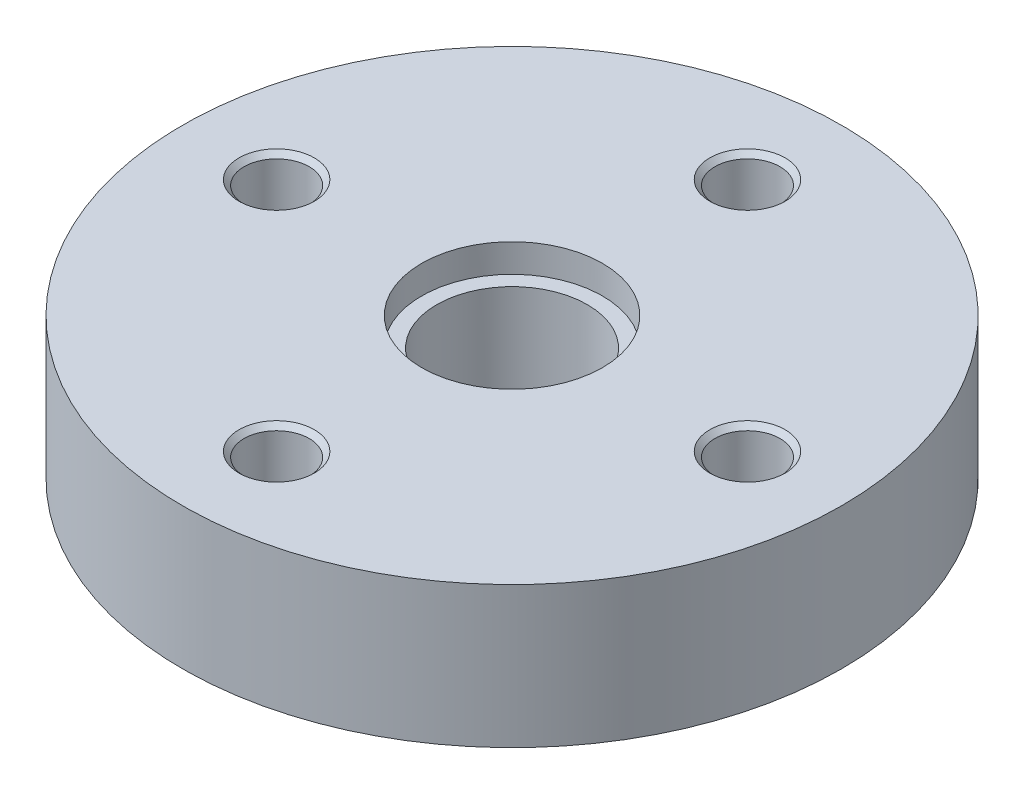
ISO-10303-21;
HEADER;
FILE_DESCRIPTION(('STEP AP214'),'2;1');
FILE_NAME('part.step','',(''),(''),'','','');
FILE_SCHEMA(('AUTOMOTIVE_DESIGN { 1 0 10303 214 1 1 1 1 }'));
ENDSEC;
DATA;
#1=APPLICATION_CONTEXT('core data for automotive mechanical design processes');
#2=APPLICATION_PROTOCOL_DEFINITION('international standard','automotive_design',2000,#1);
#3=PRODUCT_CONTEXT('',#1,'mechanical');
#4=PRODUCT('Part','Part','',(#3));
#5=PRODUCT_RELATED_PRODUCT_CATEGORY('part','',(#4));
#6=PRODUCT_DEFINITION_FORMATION('','',#4);
#7=PRODUCT_DEFINITION_CONTEXT('part definition',#1,'design');
#8=PRODUCT_DEFINITION('design','',#6,#7);
#9=PRODUCT_DEFINITION_SHAPE('','',#8);
#10=(LENGTH_UNIT() NAMED_UNIT(*) SI_UNIT(.MILLI.,.METRE.));
#11=(NAMED_UNIT(*) PLANE_ANGLE_UNIT() SI_UNIT($,.RADIAN.));
#12=(NAMED_UNIT(*) SI_UNIT($,.STERADIAN.) SOLID_ANGLE_UNIT());
#13=UNCERTAINTY_MEASURE_WITH_UNIT(LENGTH_MEASURE(1.E-05),#10,'distance_accuracy_value','');
#14=(GEOMETRIC_REPRESENTATION_CONTEXT(3) GLOBAL_UNCERTAINTY_ASSIGNED_CONTEXT((#13)) GLOBAL_UNIT_ASSIGNED_CONTEXT((#10,
#11,#12)) REPRESENTATION_CONTEXT('',''));
#15=CARTESIAN_POINT('',(0.,0.,0.));
#16=DIRECTION('',(0.,0.,1.));
#17=DIRECTION('',(1.,0.,0.));
#18=AXIS2_PLACEMENT_3D('',#15,#16,#17);
#19=CARTESIAN_POINT('',(0.,15.,0.));
#20=DIRECTION('',(0.,-1.,0.));
#21=DIRECTION('',(1.,0.,0.));
#22=AXIS2_PLACEMENT_3D('',#19,#20,#21);
#23=CYLINDRICAL_SURFACE('',#22,70.);
#24=CARTESIAN_POINT('',(0.,0.,0.));
#25=DIRECTION('',(0.,1.,0.));
#26=DIRECTION('',(1.,0.,0.));
#27=AXIS2_PLACEMENT_3D('',#24,#25,#26);
#28=CIRCLE('',#27,70.);
#29=CARTESIAN_POINT('',(70.,0.,0.));
#30=VERTEX_POINT('',#29);
#31=EDGE_CURVE('E9',#30,#30,#28,.T.);
#32=ORIENTED_EDGE('',*,*,#31,.T.);
#33=EDGE_LOOP('',(#32));
#34=FACE_BOUND('',#33,.T.);
#35=CARTESIAN_POINT('',(0.,30.,0.));
#36=DIRECTION('',(0.,1.,0.));
#37=DIRECTION('',(1.,0.,0.));
#38=AXIS2_PLACEMENT_3D('',#35,#36,#37);
#39=CIRCLE('',#38,70.);
#40=CARTESIAN_POINT('',(70.,30.,0.));
#41=VERTEX_POINT('',#40);
#42=EDGE_CURVE('E84',#41,#41,#39,.T.);
#43=ORIENTED_EDGE('',*,*,#42,.F.);
#44=EDGE_LOOP('',(#43));
#45=FACE_BOUND('',#44,.T.);
#46=ADVANCED_FACE('F15',(#34,#45),#23,.T.);
#47=CARTESIAN_POINT('',(43.,0.,0.));
#48=DIRECTION('',(0.,-1.,0.));
#49=DIRECTION('',(-1.,0.,0.));
#50=AXIS2_PLACEMENT_3D('',#47,#48,#49);
#51=PLANE('',#50);
#52=CARTESIAN_POINT('',(0.,0.,0.));
#53=DIRECTION('',(0.,1.,0.));
#54=DIRECTION('',(1.,0.,0.));
#55=AXIS2_PLACEMENT_3D('',#52,#53,#54);
#56=CIRCLE('',#55,16.);
#57=CARTESIAN_POINT('',(16.,0.,0.));
#58=VERTEX_POINT('',#57);
#59=EDGE_CURVE('E23',#58,#58,#56,.T.);
#60=ORIENTED_EDGE('',*,*,#59,.T.);
#61=EDGE_LOOP('',(#60));
#62=FACE_BOUND('',#61,.T.);
#63=ORIENTED_EDGE('',*,*,#31,.F.);
#64=EDGE_LOOP('',(#63));
#65=FACE_BOUND('',#64,.T.);
#66=ADVANCED_FACE('F252',(#62,#65),#51,.T.);
#67=CARTESIAN_POINT('',(0.,15.,0.));
#68=DIRECTION('',(0.,-1.,0.));
#69=DIRECTION('',(1.,0.,0.));
#70=AXIS2_PLACEMENT_3D('',#67,#68,#69);
#71=CYLINDRICAL_SURFACE('',#70,16.);
#72=ORIENTED_EDGE('',*,*,#59,.F.);
#73=EDGE_LOOP('',(#72));
#74=FACE_BOUND('',#73,.T.);
#75=CARTESIAN_POINT('',(0.,24.,0.));
#76=DIRECTION('',(0.,1.,0.));
#77=DIRECTION('',(1.,0.,0.));
#78=AXIS2_PLACEMENT_3D('',#75,#76,#77);
#79=CIRCLE('',#78,16.);
#80=CARTESIAN_POINT('',(-16.,24.,0.));
#81=VERTEX_POINT('',#80);
#82=EDGE_CURVE('E80',#81,#81,#79,.T.);
#83=ORIENTED_EDGE('',*,*,#82,.T.);
#84=EDGE_LOOP('',(#83));
#85=FACE_BOUND('',#84,.T.);
#86=ADVANCED_FACE('F256',(#74,#85),#71,.F.);
#87=CARTESIAN_POINT('',(43.,30.,0.));
#88=DIRECTION('',(0.,1.,0.));
#89=DIRECTION('',(1.,0.,0.));
#90=AXIS2_PLACEMENT_3D('',#87,#88,#89);
#91=PLANE('',#90);
#92=ORIENTED_EDGE('',*,*,#42,.T.);
#93=EDGE_LOOP('',(#92));
#94=FACE_BOUND('',#93,.T.);
#95=CARTESIAN_POINT('',(0.,30.,0.));
#96=DIRECTION('',(0.,-1.,0.));
#97=DIRECTION('',(1.,0.,0.));
#98=AXIS2_PLACEMENT_3D('',#95,#96,#97);
#99=CIRCLE('',#98,19.2);
#100=CARTESIAN_POINT('',(-19.2,30.,0.));
#101=VERTEX_POINT('',#100);
#102=EDGE_CURVE('E93',#101,#101,#99,.T.);
#103=ORIENTED_EDGE('',*,*,#102,.T.);
#104=EDGE_LOOP('',(#103));
#105=FACE_BOUND('',#104,.T.);
#106=CARTESIAN_POINT('',(50.,30.,0.));
#107=DIRECTION('',(0.,-1.,0.));
#108=DIRECTION('',(1.,0.,0.));
#109=AXIS2_PLACEMENT_3D('',#106,#107,#108);
#110=CIRCLE('',#109,8.);
#111=CARTESIAN_POINT('',(58.,30.,0.));
#112=VERTEX_POINT('',#111);
#113=EDGE_CURVE('E102',#112,#112,#110,.T.);
#114=ORIENTED_EDGE('',*,*,#113,.T.);
#115=EDGE_LOOP('',(#114));
#116=FACE_BOUND('',#115,.T.);
#117=CARTESIAN_POINT('',(0.,30.,-50.));
#118=DIRECTION('',(0.,-1.,0.));
#119=DIRECTION('',(0.,0.,-1.));
#120=AXIS2_PLACEMENT_3D('',#117,#118,#119);
#121=CIRCLE('',#120,8.);
#122=CARTESIAN_POINT('',(0.,30.,-58.));
#123=VERTEX_POINT('',#122);
#124=EDGE_CURVE('E114',#123,#123,#121,.T.);
#125=ORIENTED_EDGE('',*,*,#124,.T.);
#126=EDGE_LOOP('',(#125));
#127=FACE_BOUND('',#126,.T.);
#128=CARTESIAN_POINT('',(-50.,30.,0.));
#129=DIRECTION('',(0.,-1.,0.));
#130=DIRECTION('',(-1.,0.,0.));
#131=AXIS2_PLACEMENT_3D('',#128,#129,#130);
#132=CIRCLE('',#131,8.);
#133=CARTESIAN_POINT('',(-58.,30.,0.));
#134=VERTEX_POINT('',#133);
#135=EDGE_CURVE('E125',#134,#134,#132,.T.);
#136=ORIENTED_EDGE('',*,*,#135,.T.);
#137=EDGE_LOOP('',(#136));
#138=FACE_BOUND('',#137,.T.);
#139=CARTESIAN_POINT('',(0.,30.,50.));
#140=DIRECTION('',(0.,-1.,0.));
#141=DIRECTION('',(0.,0.,1.));
#142=AXIS2_PLACEMENT_3D('',#139,#140,#141);
#143=CIRCLE('',#142,8.);
#144=CARTESIAN_POINT('',(0.,30.,58.));
#145=VERTEX_POINT('',#144);
#146=EDGE_CURVE('E139',#145,#145,#143,.T.);
#147=ORIENTED_EDGE('',*,*,#146,.T.);
#148=EDGE_LOOP('',(#147));
#149=FACE_BOUND('',#148,.T.);
#150=ADVANCED_FACE('F85',(#94,#105,#116,#127,#138,#149),#91,.T.);
#151=CARTESIAN_POINT('',(0.,24.,0.));
#152=DIRECTION('',(0.,-1.,0.));
#153=DIRECTION('',(-1.,0.,0.));
#154=AXIS2_PLACEMENT_3D('',#151,#152,#153);
#155=PLANE('',#154);
#156=CARTESIAN_POINT('',(0.,24.,0.));
#157=DIRECTION('',(0.,-1.,0.));
#158=DIRECTION('',(1.,0.,0.));
#159=AXIS2_PLACEMENT_3D('',#156,#157,#158);
#160=CIRCLE('',#159,19.2);
#161=CARTESIAN_POINT('',(19.2,24.,0.));
#162=VERTEX_POINT('',#161);
#163=EDGE_CURVE('E89',#162,#162,#160,.T.);
#164=ORIENTED_EDGE('',*,*,#163,.F.);
#165=EDGE_LOOP('',(#164));
#166=FACE_BOUND('',#165,.T.);
#167=ORIENTED_EDGE('',*,*,#82,.F.);
#168=EDGE_LOOP('',(#167));
#169=FACE_BOUND('',#168,.T.);
#170=ADVANCED_FACE('F267',(#166,#169),#155,.F.);
#171=CARTESIAN_POINT('',(0.,28.5,0.));
#172=DIRECTION('',(0.,-1.,0.));
#173=DIRECTION('',(1.,0.,0.));
#174=AXIS2_PLACEMENT_3D('',#171,#172,#173);
#175=CYLINDRICAL_SURFACE('',#174,19.2);
#176=ORIENTED_EDGE('',*,*,#163,.T.);
#177=EDGE_LOOP('',(#176));
#178=FACE_BOUND('',#177,.T.);
#179=ORIENTED_EDGE('',*,*,#102,.F.);
#180=EDGE_LOOP('',(#179));
#181=FACE_BOUND('',#180,.T.);
#182=ADVANCED_FACE('F270',(#178,#181),#175,.F.);
#183=CARTESIAN_POINT('',(50.,5.00308975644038,0.));
#184=DIRECTION('',(0.,1.,0.));
#185=DIRECTION('',(1.,0.,0.));
#186=AXIS2_PLACEMENT_3D('',#183,#184,#185);
#187=CONICAL_SURFACE('',#186,3.45875,1.0471975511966);
#188=CARTESIAN_POINT('',(50.,7.,0.));
#189=DIRECTION('',(0.,-1.,0.));
#190=DIRECTION('',(1.,0.,0.));
#191=AXIS2_PLACEMENT_3D('',#188,#189,#190);
#192=CIRCLE('',#191,6.9175);
#193=CARTESIAN_POINT('',(56.9175,7.,0.));
#194=VERTEX_POINT('',#193);
#195=EDGE_CURVE('E95',#194,#194,#192,.T.);
#196=ORIENTED_EDGE('',*,*,#195,.F.);
#197=EDGE_LOOP('',(#196));
#198=FACE_BOUND('',#197,.T.);
#199=CARTESIAN_POINT('',(50.,3.00617951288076,0.));
#200=VERTEX_POINT('',#199);
#201=VERTEX_LOOP('',#200);
#202=FACE_BOUND('',#201,.T.);
#203=ADVANCED_FACE('F272',(#198,#202),#187,.F.);
#204=CARTESIAN_POINT('',(50.,9.95875,0.));
#205=DIRECTION('',(0.,1.,0.));
#206=DIRECTION('',(1.,0.,0.));
#207=AXIS2_PLACEMENT_3D('',#204,#205,#206);
#208=CYLINDRICAL_SURFACE('',#207,6.9175);
#209=CARTESIAN_POINT('',(50.,12.9175,0.));
#210=DIRECTION('',(0.,-1.,0.));
#211=DIRECTION('',(1.,0.,0.));
#212=AXIS2_PLACEMENT_3D('',#209,#210,#211);
#213=CIRCLE('',#212,6.9175);
#214=CARTESIAN_POINT('',(56.9175,12.9175,0.));
#215=VERTEX_POINT('',#214);
#216=EDGE_CURVE('E97',#215,#215,#213,.T.);
#217=ORIENTED_EDGE('',*,*,#216,.F.);
#218=EDGE_LOOP('',(#217));
#219=FACE_BOUND('',#218,.T.);
#220=ORIENTED_EDGE('',*,*,#195,.T.);
#221=EDGE_LOOP('',(#220));
#222=FACE_BOUND('',#221,.T.);
#223=ADVANCED_FACE('F275',(#219,#222),#208,.F.);
#224=CARTESIAN_POINT('',(50.,13.45875,0.));
#225=DIRECTION('',(0.,1.,0.));
#226=DIRECTION('',(1.,0.,0.));
#227=AXIS2_PLACEMENT_3D('',#224,#225,#226);
#228=CONICAL_SURFACE('',#227,7.45875,0.785398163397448);
#229=CARTESIAN_POINT('',(50.,14.,0.));
#230=DIRECTION('',(0.,-1.,0.));
#231=DIRECTION('',(1.,0.,0.));
#232=AXIS2_PLACEMENT_3D('',#229,#230,#231);
#233=CIRCLE('',#232,8.);
#234=CARTESIAN_POINT('',(58.,14.,0.));
#235=VERTEX_POINT('',#234);
#236=EDGE_CURVE('E98',#235,#235,#233,.T.);
#237=ORIENTED_EDGE('',*,*,#236,.F.);
#238=EDGE_LOOP('',(#237));
#239=FACE_BOUND('',#238,.T.);
#240=ORIENTED_EDGE('',*,*,#216,.T.);
#241=EDGE_LOOP('',(#240));
#242=FACE_BOUND('',#241,.T.);
#243=ADVANCED_FACE('F279',(#239,#242),#228,.F.);
#244=CARTESIAN_POINT('',(57.45875,14.,0.));
#245=DIRECTION('',(0.,1.,0.));
#246=DIRECTION('',(-1.,0.,0.));
#247=AXIS2_PLACEMENT_3D('',#244,#245,#246);
#248=PLANE('',#247);
#249=CARTESIAN_POINT('',(50.,14.,0.));
#250=DIRECTION('',(0.,-1.,0.));
#251=DIRECTION('',(1.,0.,0.));
#252=AXIS2_PLACEMENT_3D('',#249,#250,#251);
#253=CIRCLE('',#252,6.9175);
#254=CARTESIAN_POINT('',(56.9175,14.,0.));
#255=VERTEX_POINT('',#254);
#256=EDGE_CURVE('E100',#255,#255,#253,.T.);
#257=ORIENTED_EDGE('',*,*,#256,.F.);
#258=EDGE_LOOP('',(#257));
#259=FACE_BOUND('',#258,.T.);
#260=ORIENTED_EDGE('',*,*,#236,.T.);
#261=EDGE_LOOP('',(#260));
#262=FACE_BOUND('',#261,.T.);
#263=ADVANCED_FACE('F283',(#259,#262),#248,.F.);
#264=CARTESIAN_POINT('',(50.,21.45875,0.));
#265=DIRECTION('',(0.,1.,0.));
#266=DIRECTION('',(1.,0.,0.));
#267=AXIS2_PLACEMENT_3D('',#264,#265,#266);
#268=CYLINDRICAL_SURFACE('',#267,6.9175);
#269=CARTESIAN_POINT('',(50.,28.9175,0.));
#270=DIRECTION('',(0.,-1.,0.));
#271=DIRECTION('',(1.,0.,0.));
#272=AXIS2_PLACEMENT_3D('',#269,#270,#271);
#273=CIRCLE('',#272,6.9175);
#274=CARTESIAN_POINT('',(56.9175,28.9175,0.));
#275=VERTEX_POINT('',#274);
#276=EDGE_CURVE('E104',#275,#275,#273,.T.);
#277=ORIENTED_EDGE('',*,*,#276,.F.);
#278=EDGE_LOOP('',(#277));
#279=FACE_BOUND('',#278,.T.);
#280=ORIENTED_EDGE('',*,*,#256,.T.);
#281=EDGE_LOOP('',(#280));
#282=FACE_BOUND('',#281,.T.);
#283=ADVANCED_FACE('F287',(#279,#282),#268,.F.);
#284=CARTESIAN_POINT('',(50.,29.45875,0.));
#285=DIRECTION('',(0.,1.,0.));
#286=DIRECTION('',(1.,0.,0.));
#287=AXIS2_PLACEMENT_3D('',#284,#285,#286);
#288=CONICAL_SURFACE('',#287,7.45875,0.785398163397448);
#289=ORIENTED_EDGE('',*,*,#113,.F.);
#290=EDGE_LOOP('',(#289));
#291=FACE_BOUND('',#290,.T.);
#292=ORIENTED_EDGE('',*,*,#276,.T.);
#293=EDGE_LOOP('',(#292));
#294=FACE_BOUND('',#293,.T.);
#295=ADVANCED_FACE('F291',(#291,#294),#288,.F.);
#296=CARTESIAN_POINT('',(0.,5.00308975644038,-50.));
#297=DIRECTION('',(0.,1.,0.));
#298=DIRECTION('',(0.,0.,-1.));
#299=AXIS2_PLACEMENT_3D('',#296,#297,#298);
#300=CONICAL_SURFACE('',#299,3.45875,1.0471975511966);
#301=CARTESIAN_POINT('',(0.,7.,-50.));
#302=DIRECTION('',(0.,-1.,0.));
#303=DIRECTION('',(0.,0.,-1.));
#304=AXIS2_PLACEMENT_3D('',#301,#302,#303);
#305=CIRCLE('',#304,6.9175);
#306=CARTESIAN_POINT('',(0.,7.,-56.9175));
#307=VERTEX_POINT('',#306);
#308=EDGE_CURVE('E106',#307,#307,#305,.T.);
#309=ORIENTED_EDGE('',*,*,#308,.F.);
#310=EDGE_LOOP('',(#309));
#311=FACE_BOUND('',#310,.T.);
#312=CARTESIAN_POINT('',(0.,3.00617951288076,-50.));
#313=VERTEX_POINT('',#312);
#314=VERTEX_LOOP('',#313);
#315=FACE_BOUND('',#314,.T.);
#316=ADVANCED_FACE('F295',(#311,#315),#300,.F.);
#317=CARTESIAN_POINT('',(0.,9.95875,-50.));
#318=DIRECTION('',(0.,1.,0.));
#319=DIRECTION('',(0.,0.,-1.));
#320=AXIS2_PLACEMENT_3D('',#317,#318,#319);
#321=CYLINDRICAL_SURFACE('',#320,6.9175);
#322=CARTESIAN_POINT('',(0.,12.9175,-50.));
#323=DIRECTION('',(0.,-1.,0.));
#324=DIRECTION('',(0.,0.,-1.));
#325=AXIS2_PLACEMENT_3D('',#322,#323,#324);
#326=CIRCLE('',#325,6.9175);
#327=CARTESIAN_POINT('',(0.,12.9175,-56.9175));
#328=VERTEX_POINT('',#327);
#329=EDGE_CURVE('E108',#328,#328,#326,.T.);
#330=ORIENTED_EDGE('',*,*,#329,.F.);
#331=EDGE_LOOP('',(#330));
#332=FACE_BOUND('',#331,.T.);
#333=ORIENTED_EDGE('',*,*,#308,.T.);
#334=EDGE_LOOP('',(#333));
#335=FACE_BOUND('',#334,.T.);
#336=ADVANCED_FACE('F299',(#332,#335),#321,.F.);
#337=CARTESIAN_POINT('',(0.,13.45875,-50.));
#338=DIRECTION('',(0.,1.,0.));
#339=DIRECTION('',(0.,0.,-1.));
#340=AXIS2_PLACEMENT_3D('',#337,#338,#339);
#341=CONICAL_SURFACE('',#340,7.45875,0.785398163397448);
#342=CARTESIAN_POINT('',(0.,14.,-50.));
#343=DIRECTION('',(0.,-1.,0.));
#344=DIRECTION('',(0.,0.,-1.));
#345=AXIS2_PLACEMENT_3D('',#342,#343,#344);
#346=CIRCLE('',#345,8.);
#347=CARTESIAN_POINT('',(0.,14.,-58.));
#348=VERTEX_POINT('',#347);
#349=EDGE_CURVE('E110',#348,#348,#346,.T.);
#350=ORIENTED_EDGE('',*,*,#349,.F.);
#351=EDGE_LOOP('',(#350));
#352=FACE_BOUND('',#351,.T.);
#353=ORIENTED_EDGE('',*,*,#329,.T.);
#354=EDGE_LOOP('',(#353));
#355=FACE_BOUND('',#354,.T.);
#356=ADVANCED_FACE('F303',(#352,#355),#341,.F.);
#357=CARTESIAN_POINT('',(0.,14.,-57.45875));
#358=DIRECTION('',(0.,1.,0.));
#359=DIRECTION('',(0.,0.,1.));
#360=AXIS2_PLACEMENT_3D('',#357,#358,#359);
#361=PLANE('',#360);
#362=CARTESIAN_POINT('',(0.,14.,-50.));
#363=DIRECTION('',(0.,-1.,0.));
#364=DIRECTION('',(0.,0.,-1.));
#365=AXIS2_PLACEMENT_3D('',#362,#363,#364);
#366=CIRCLE('',#365,6.9175);
#367=CARTESIAN_POINT('',(0.,14.,-56.9175));
#368=VERTEX_POINT('',#367);
#369=EDGE_CURVE('E112',#368,#368,#366,.T.);
#370=ORIENTED_EDGE('',*,*,#369,.F.);
#371=EDGE_LOOP('',(#370));
#372=FACE_BOUND('',#371,.T.);
#373=ORIENTED_EDGE('',*,*,#349,.T.);
#374=EDGE_LOOP('',(#373));
#375=FACE_BOUND('',#374,.T.);
#376=ADVANCED_FACE('F307',(#372,#375),#361,.F.);
#377=CARTESIAN_POINT('',(0.,21.45875,-50.));
#378=DIRECTION('',(0.,1.,0.));
#379=DIRECTION('',(0.,0.,-1.));
#380=AXIS2_PLACEMENT_3D('',#377,#378,#379);
#381=CYLINDRICAL_SURFACE('',#380,6.9175);
#382=CARTESIAN_POINT('',(0.,28.9175,-50.));
#383=DIRECTION('',(0.,-1.,0.));
#384=DIRECTION('',(0.,0.,-1.));
#385=AXIS2_PLACEMENT_3D('',#382,#383,#384);
#386=CIRCLE('',#385,6.9175);
#387=CARTESIAN_POINT('',(0.,28.9175,-56.9175));
#388=VERTEX_POINT('',#387);
#389=EDGE_CURVE('E126',#388,#388,#386,.T.);
#390=ORIENTED_EDGE('',*,*,#389,.F.);
#391=EDGE_LOOP('',(#390));
#392=FACE_BOUND('',#391,.T.);
#393=ORIENTED_EDGE('',*,*,#369,.T.);
#394=EDGE_LOOP('',(#393));
#395=FACE_BOUND('',#394,.T.);
#396=ADVANCED_FACE('F311',(#392,#395),#381,.F.);
#397=CARTESIAN_POINT('',(0.,29.45875,-50.));
#398=DIRECTION('',(0.,1.,0.));
#399=DIRECTION('',(0.,0.,-1.));
#400=AXIS2_PLACEMENT_3D('',#397,#398,#399);
#401=CONICAL_SURFACE('',#400,7.45875,0.785398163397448);
#402=ORIENTED_EDGE('',*,*,#124,.F.);
#403=EDGE_LOOP('',(#402));
#404=FACE_BOUND('',#403,.T.);
#405=ORIENTED_EDGE('',*,*,#389,.T.);
#406=EDGE_LOOP('',(#405));
#407=FACE_BOUND('',#406,.T.);
#408=ADVANCED_FACE('F208',(#404,#407),#401,.F.);
#409=CARTESIAN_POINT('',(-50.,5.00308975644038,0.));
#410=DIRECTION('',(0.,1.,0.));
#411=DIRECTION('',(-1.,0.,0.));
#412=AXIS2_PLACEMENT_3D('',#409,#410,#411);
#413=CONICAL_SURFACE('',#412,3.45875,1.0471975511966);
#414=CARTESIAN_POINT('',(-50.,7.,0.));
#415=DIRECTION('',(0.,-1.,0.));
#416=DIRECTION('',(-1.,0.,0.));
#417=AXIS2_PLACEMENT_3D('',#414,#415,#416);
#418=CIRCLE('',#417,6.9175);
#419=CARTESIAN_POINT('',(-56.9175,7.,0.));
#420=VERTEX_POINT('',#419);
#421=EDGE_CURVE('E118',#420,#420,#418,.T.);
#422=ORIENTED_EDGE('',*,*,#421,.F.);
#423=EDGE_LOOP('',(#422));
#424=FACE_BOUND('',#423,.T.);
#425=CARTESIAN_POINT('',(-50.,3.00617951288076,0.));
#426=VERTEX_POINT('',#425);
#427=VERTEX_LOOP('',#426);
#428=FACE_BOUND('',#427,.T.);
#429=ADVANCED_FACE('F200',(#424,#428),#413,.F.);
#430=CARTESIAN_POINT('',(-50.,9.95875,0.));
#431=DIRECTION('',(0.,1.,0.));
#432=DIRECTION('',(-1.,0.,0.));
#433=AXIS2_PLACEMENT_3D('',#430,#431,#432);
#434=CYLINDRICAL_SURFACE('',#433,6.9175);
#435=CARTESIAN_POINT('',(-50.,12.9175,0.));
#436=DIRECTION('',(0.,-1.,0.));
#437=DIRECTION('',(-1.,0.,0.));
#438=AXIS2_PLACEMENT_3D('',#435,#436,#437);
#439=CIRCLE('',#438,6.9175);
#440=CARTESIAN_POINT('',(-56.9175,12.9175,0.));
#441=VERTEX_POINT('',#440);
#442=EDGE_CURVE('E115',#441,#441,#439,.T.);
#443=ORIENTED_EDGE('',*,*,#442,.F.);
#444=EDGE_LOOP('',(#443));
#445=FACE_BOUND('',#444,.T.);
#446=ORIENTED_EDGE('',*,*,#421,.T.);
#447=EDGE_LOOP('',(#446));
#448=FACE_BOUND('',#447,.T.);
#449=ADVANCED_FACE('F192',(#445,#448),#434,.F.);
#450=CARTESIAN_POINT('',(-50.,13.45875,0.));
#451=DIRECTION('',(0.,1.,0.));
#452=DIRECTION('',(-1.,0.,0.));
#453=AXIS2_PLACEMENT_3D('',#450,#451,#452);
#454=CONICAL_SURFACE('',#453,7.45875,0.785398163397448);
#455=CARTESIAN_POINT('',(-50.,14.,0.));
#456=DIRECTION('',(0.,-1.,0.));
#457=DIRECTION('',(-1.,0.,0.));
#458=AXIS2_PLACEMENT_3D('',#455,#456,#457);
#459=CIRCLE('',#458,8.);
#460=CARTESIAN_POINT('',(-58.,14.,0.));
#461=VERTEX_POINT('',#460);
#462=EDGE_CURVE('E119',#461,#461,#459,.T.);
#463=ORIENTED_EDGE('',*,*,#462,.F.);
#464=EDGE_LOOP('',(#463));
#465=FACE_BOUND('',#464,.T.);
#466=ORIENTED_EDGE('',*,*,#442,.T.);
#467=EDGE_LOOP('',(#466));
#468=FACE_BOUND('',#467,.T.);
#469=ADVANCED_FACE('F184',(#465,#468),#454,.F.);
#470=CARTESIAN_POINT('',(-57.45875,14.,0.));
#471=DIRECTION('',(0.,1.,0.));
#472=DIRECTION('',(1.,0.,0.));
#473=AXIS2_PLACEMENT_3D('',#470,#471,#472);
#474=PLANE('',#473);
#475=CARTESIAN_POINT('',(-50.,14.,0.));
#476=DIRECTION('',(0.,-1.,0.));
#477=DIRECTION('',(-1.,0.,0.));
#478=AXIS2_PLACEMENT_3D('',#475,#476,#477);
#479=CIRCLE('',#478,6.9175);
#480=CARTESIAN_POINT('',(-56.9175,14.,0.));
#481=VERTEX_POINT('',#480);
#482=EDGE_CURVE('E122',#481,#481,#479,.T.);
#483=ORIENTED_EDGE('',*,*,#482,.F.);
#484=EDGE_LOOP('',(#483));
#485=FACE_BOUND('',#484,.T.);
#486=ORIENTED_EDGE('',*,*,#462,.T.);
#487=EDGE_LOOP('',(#486));
#488=FACE_BOUND('',#487,.T.);
#489=ADVANCED_FACE('F176',(#485,#488),#474,.F.);
#490=CARTESIAN_POINT('',(-50.,21.45875,0.));
#491=DIRECTION('',(0.,1.,0.));
#492=DIRECTION('',(-1.,0.,0.));
#493=AXIS2_PLACEMENT_3D('',#490,#491,#492);
#494=CYLINDRICAL_SURFACE('',#493,6.9175);
#495=CARTESIAN_POINT('',(-50.,28.9175,0.));
#496=DIRECTION('',(0.,-1.,0.));
#497=DIRECTION('',(-1.,0.,0.));
#498=AXIS2_PLACEMENT_3D('',#495,#496,#497);
#499=CIRCLE('',#498,6.9175);
#500=CARTESIAN_POINT('',(-56.9175,28.9175,0.));
#501=VERTEX_POINT('',#500);
#502=EDGE_CURVE('E140',#501,#501,#499,.T.);
#503=ORIENTED_EDGE('',*,*,#502,.F.);
#504=EDGE_LOOP('',(#503));
#505=FACE_BOUND('',#504,.T.);
#506=ORIENTED_EDGE('',*,*,#482,.T.);
#507=EDGE_LOOP('',(#506));
#508=FACE_BOUND('',#507,.T.);
#509=ADVANCED_FACE('F168',(#505,#508),#494,.F.);
#510=CARTESIAN_POINT('',(-50.,29.45875,0.));
#511=DIRECTION('',(0.,1.,0.));
#512=DIRECTION('',(-1.,0.,0.));
#513=AXIS2_PLACEMENT_3D('',#510,#511,#512);
#514=CONICAL_SURFACE('',#513,7.45875,0.785398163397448);
#515=ORIENTED_EDGE('',*,*,#135,.F.);
#516=EDGE_LOOP('',(#515));
#517=FACE_BOUND('',#516,.T.);
#518=ORIENTED_EDGE('',*,*,#502,.T.);
#519=EDGE_LOOP('',(#518));
#520=FACE_BOUND('',#519,.T.);
#521=ADVANCED_FACE('F164',(#517,#520),#514,.F.);
#522=CARTESIAN_POINT('',(0.,5.00308975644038,50.));
#523=DIRECTION('',(0.,1.,0.));
#524=DIRECTION('',(0.,0.,1.));
#525=AXIS2_PLACEMENT_3D('',#522,#523,#524);
#526=CONICAL_SURFACE('',#525,3.45875,1.0471975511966);
#527=CARTESIAN_POINT('',(0.,7.,50.));
#528=DIRECTION('',(0.,-1.,0.));
#529=DIRECTION('',(0.,0.,1.));
#530=AXIS2_PLACEMENT_3D('',#527,#528,#529);
#531=CIRCLE('',#530,6.9175);
#532=CARTESIAN_POINT('',(0.,7.,56.9175));
#533=VERTEX_POINT('',#532);
#534=EDGE_CURVE('E132',#533,#533,#531,.T.);
#535=ORIENTED_EDGE('',*,*,#534,.F.);
#536=EDGE_LOOP('',(#535));
#537=FACE_BOUND('',#536,.T.);
#538=CARTESIAN_POINT('',(0.,3.00617951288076,50.));
#539=VERTEX_POINT('',#538);
#540=VERTEX_LOOP('',#539);
#541=FACE_BOUND('',#540,.T.);
#542=ADVANCED_FACE('F167',(#537,#541),#526,.F.);
#543=CARTESIAN_POINT('',(0.,9.95875,50.));
#544=DIRECTION('',(0.,1.,0.));
#545=DIRECTION('',(0.,0.,1.));
#546=AXIS2_PLACEMENT_3D('',#543,#544,#545);
#547=CYLINDRICAL_SURFACE('',#546,6.9175);
#548=CARTESIAN_POINT('',(0.,12.9175,50.));
#549=DIRECTION('',(0.,-1.,0.));
#550=DIRECTION('',(0.,0.,1.));
#551=AXIS2_PLACEMENT_3D('',#548,#549,#550);
#552=CIRCLE('',#551,6.9175);
#553=CARTESIAN_POINT('',(0.,12.9175,56.9175));
#554=VERTEX_POINT('',#553);
#555=EDGE_CURVE('E129',#554,#554,#552,.T.);
#556=ORIENTED_EDGE('',*,*,#555,.F.);
#557=EDGE_LOOP('',(#556));
#558=FACE_BOUND('',#557,.T.);
#559=ORIENTED_EDGE('',*,*,#534,.T.);
#560=EDGE_LOOP('',(#559));
#561=FACE_BOUND('',#560,.T.);
#562=ADVANCED_FACE('F321',(#558,#561),#547,.F.);
#563=CARTESIAN_POINT('',(0.,13.45875,50.));
#564=DIRECTION('',(0.,1.,0.));
#565=DIRECTION('',(0.,0.,1.));
#566=AXIS2_PLACEMENT_3D('',#563,#564,#565);
#567=CONICAL_SURFACE('',#566,7.45875,0.785398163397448);
#568=CARTESIAN_POINT('',(0.,14.,50.));
#569=DIRECTION('',(0.,-1.,0.));
#570=DIRECTION('',(0.,0.,1.));
#571=AXIS2_PLACEMENT_3D('',#568,#569,#570);
#572=CIRCLE('',#571,8.);
#573=CARTESIAN_POINT('',(0.,14.,58.));
#574=VERTEX_POINT('',#573);
#575=EDGE_CURVE('E133',#574,#574,#572,.T.);
#576=ORIENTED_EDGE('',*,*,#575,.F.);
#577=EDGE_LOOP('',(#576));
#578=FACE_BOUND('',#577,.T.);
#579=ORIENTED_EDGE('',*,*,#555,.T.);
#580=EDGE_LOOP('',(#579));
#581=FACE_BOUND('',#580,.T.);
#582=ADVANCED_FACE('F326',(#578,#581),#567,.F.);
#583=CARTESIAN_POINT('',(0.,14.,57.45875));
#584=DIRECTION('',(0.,1.,0.));
#585=DIRECTION('',(0.,0.,-1.));
#586=AXIS2_PLACEMENT_3D('',#583,#584,#585);
#587=PLANE('',#586);
#588=CARTESIAN_POINT('',(0.,14.,50.));
#589=DIRECTION('',(0.,-1.,0.));
#590=DIRECTION('',(0.,0.,1.));
#591=AXIS2_PLACEMENT_3D('',#588,#589,#590);
#592=CIRCLE('',#591,6.9175);
#593=CARTESIAN_POINT('',(0.,14.,56.9175));
#594=VERTEX_POINT('',#593);
#595=EDGE_CURVE('E136',#594,#594,#592,.T.);
#596=ORIENTED_EDGE('',*,*,#595,.F.);
#597=EDGE_LOOP('',(#596));
#598=FACE_BOUND('',#597,.T.);
#599=ORIENTED_EDGE('',*,*,#575,.T.);
#600=EDGE_LOOP('',(#599));
#601=FACE_BOUND('',#600,.T.);
#602=ADVANCED_FACE('F247',(#598,#601),#587,.F.);
#603=CARTESIAN_POINT('',(0.,21.45875,50.));
#604=DIRECTION('',(0.,1.,0.));
#605=DIRECTION('',(0.,0.,1.));
#606=AXIS2_PLACEMENT_3D('',#603,#604,#605);
#607=CYLINDRICAL_SURFACE('',#606,6.9175);
#608=CARTESIAN_POINT('',(0.,28.9175,50.));
#609=DIRECTION('',(0.,-1.,0.));
#610=DIRECTION('',(0.,0.,1.));
#611=AXIS2_PLACEMENT_3D('',#608,#609,#610);
#612=CIRCLE('',#611,6.9175);
#613=CARTESIAN_POINT('',(0.,28.9175,56.9175));
#614=VERTEX_POINT('',#613);
#615=EDGE_CURVE('E150',#614,#614,#612,.T.);
#616=ORIENTED_EDGE('',*,*,#615,.F.);
#617=EDGE_LOOP('',(#616));
#618=FACE_BOUND('',#617,.T.);
#619=ORIENTED_EDGE('',*,*,#595,.T.);
#620=EDGE_LOOP('',(#619));
#621=FACE_BOUND('',#620,.T.);
#622=ADVANCED_FACE('F241',(#618,#621),#607,.F.);
#623=CARTESIAN_POINT('',(0.,29.45875,50.));
#624=DIRECTION('',(0.,1.,0.));
#625=DIRECTION('',(0.,0.,1.));
#626=AXIS2_PLACEMENT_3D('',#623,#624,#625);
#627=CONICAL_SURFACE('',#626,7.45875,0.785398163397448);
#628=ORIENTED_EDGE('',*,*,#146,.F.);
#629=EDGE_LOOP('',(#628));
#630=FACE_BOUND('',#629,.T.);
#631=ORIENTED_EDGE('',*,*,#615,.T.);
#632=EDGE_LOOP('',(#631));
#633=FACE_BOUND('',#632,.T.);
#634=ADVANCED_FACE('F239',(#630,#633),#627,.F.);
#635=CLOSED_SHELL('',(#46,#66,#86,#150,#170,#182,#203,#223,#243,#263,#283,#295,#316,#336,#356,
#376,#396,#408,#429,#449,#469,#489,#509,#521,#542,#562,#582,#602,#622,#634));
#636=MANIFOLD_SOLID_BREP('B1',#635);
#637=ADVANCED_BREP_SHAPE_REPRESENTATION('',(#18,#636),#14);
#638=SHAPE_DEFINITION_REPRESENTATION(#9,#637);
ENDSEC;
END-ISO-10303-21;
